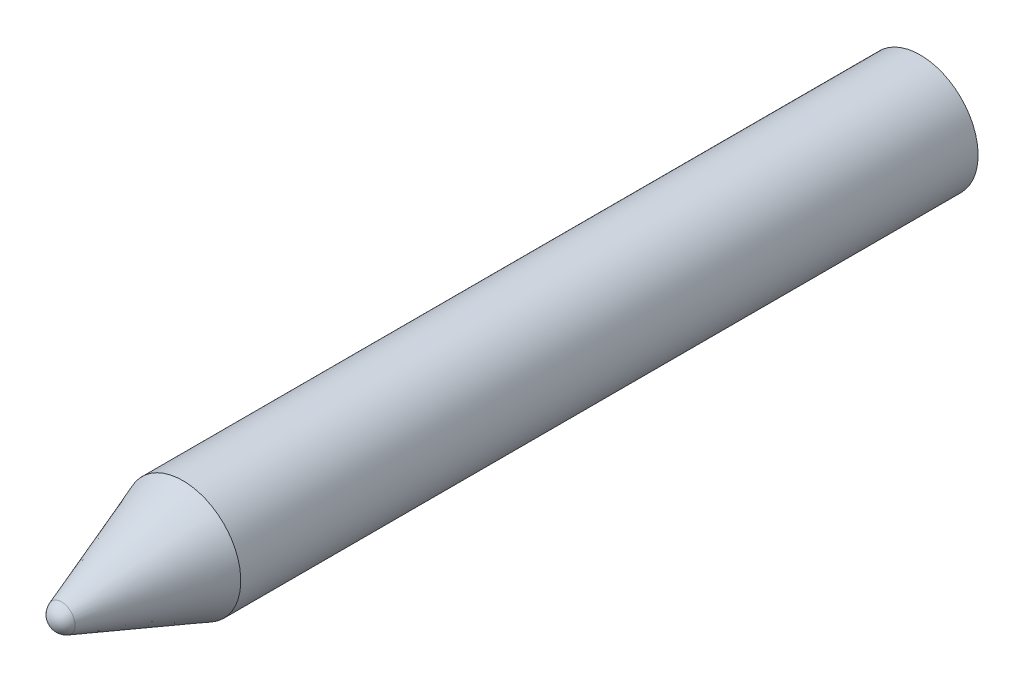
from build123d import *


with BuildPart() as part:
    # Skizze1 → Rotation1 (revolve)
    with BuildSketch(Plane(origin=(0, 0, 0), x_dir=(1, 0, 0), z_dir=(0, 1, 0))):
        with BuildLine():
            Line((-1.878865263, -50.551733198), (-8, -33.773706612))
            Line((-8, -33.773706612), (-8, 68.133734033))
            Line((-8, 68.133734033), (0, 68.133734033))
            Line((0, 68.133734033), (0, -51.866265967))
            ThreePointArc((0, -51.866265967), (-1.146530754, -51.505005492), (-1.878865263, -50.551733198))
        make_face()
    revolve(axis=Axis((0, 0, -93.062872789), (0, 0, 1)))


solid = part.part
